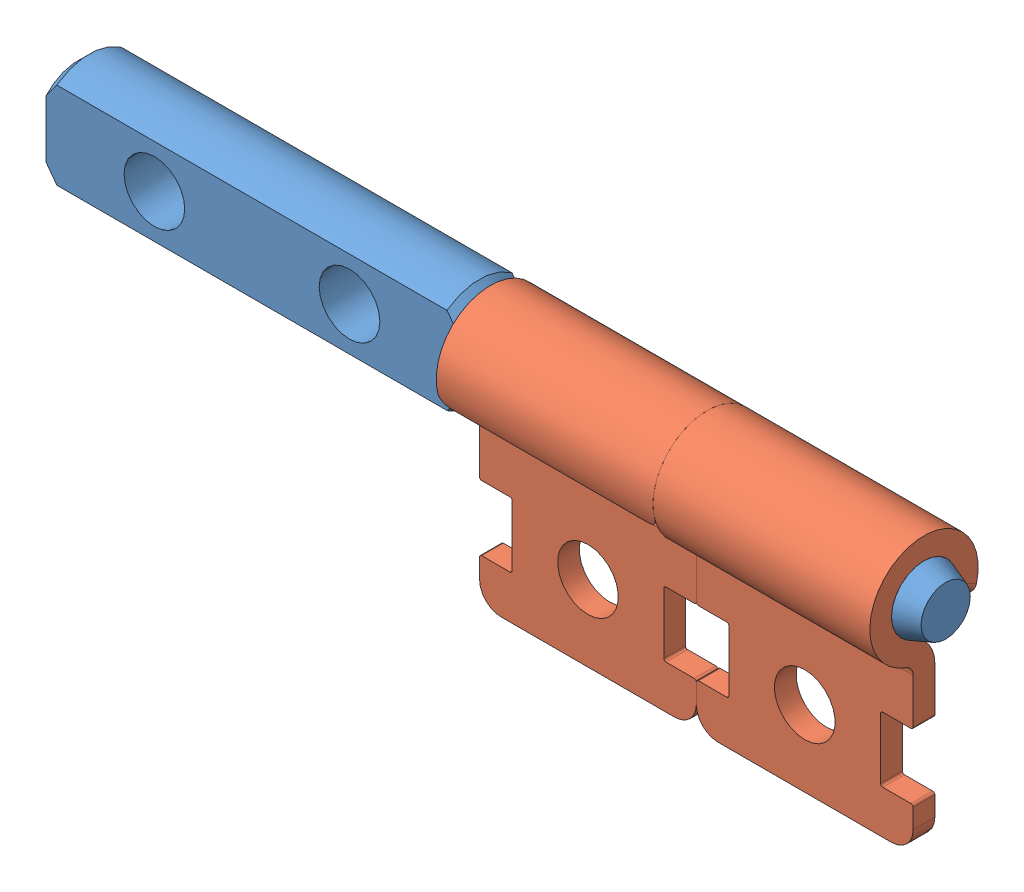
SolidWorks assembly ST080B0.SLDASM, configuration Default (file format 7000). Lengths in mm.
Overall size (40 12.5 5).
3 component instances, 2 part files, 6 mates.
Components (placement in the parent):
- ST080 SHAFT-1: ST080 SHAFT.SLDPRT [ST080B0] at (1.5604 0.3344 40) size (40 5 3)
- ST040 Bracket-1: ST040 Bracket.SLDPRT [Default] at (30.5604 0.3344 40) x (-1 0 0) z (0 0 -1) size (10.06 12.5 5)
- ST040 Bracket-2: ST040 Bracket.SLDPRT [Default] at (30.5604 0.3344 40) size (10.06 12.5 5)
Mates (geometry in assembly coordinates):
- Coincident1: coincident anti-aligned: plane of ST040 Bracket-1 through (30.5604 -2.4941 39) normal (1 0 0); plane of ST040 Bracket-2 through (30.5604 -2.4941 41) normal (-1 0 0)
- Concentric1: concentric anti-aligned: cylinder of ST040 Bracket-1 through (20.5604 0.3344 40) axis (1 0 0) radius 1.5; cylinder of ST040 Bracket-2 through (40.5604 0.3344 40) axis (-1 0 0) radius 1.5
- Coincident2: coincident aligned: plane of ST040 Bracket-1 through (20.5604 -2.4941 40.5) normal (0 0 1); plane of ST040 Bracket-2 through (40.5604 -2.4941 40.5) normal (0 0 1)
- Concentric2: concentric: cylinder of ST080 SHAFT-1 through (1.5604 0.3344 40) axis (-1 0 0) radius 1.5; cylinder of ST040 Bracket-1 through (20.5604 0.3344 40) axis (1 0 0) radius 1.5
- Coincident3: coincident: plane of ST080 SHAFT-1 through (20.5604 2.3344 40) normal (1 0 0); plane of ST040 Bracket-1 through (20.5604 -2.4941 39) normal (-1 0 0)
- Parallel1: parallel aligned: plane of ST080 SHAFT-1 through (20.5604 -2.1656 41.5) normal (0 0 1); plane of ST040 Bracket-1 through (20.5604 -2.4941 40.5) normal (0 0 1)
